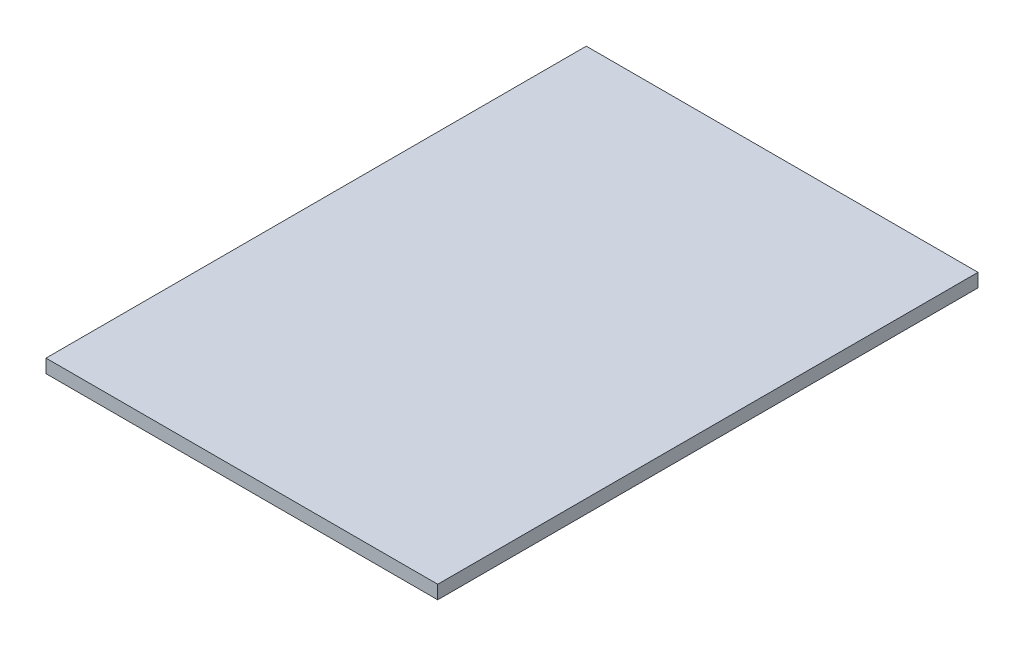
ISO-10303-21;
HEADER;
FILE_DESCRIPTION(('STEP AP214'),'2;1');
FILE_NAME('part.step','',(''),(''),'','','');
FILE_SCHEMA(('AUTOMOTIVE_DESIGN { 1 0 10303 214 1 1 1 1 }'));
ENDSEC;
DATA;
#1=APPLICATION_CONTEXT('core data for automotive mechanical design processes');
#2=APPLICATION_PROTOCOL_DEFINITION('international standard','automotive_design',2000,#1);
#3=PRODUCT_CONTEXT('',#1,'mechanical');
#4=PRODUCT('Part','Part','',(#3));
#5=PRODUCT_RELATED_PRODUCT_CATEGORY('part','',(#4));
#6=PRODUCT_DEFINITION_FORMATION('','',#4);
#7=PRODUCT_DEFINITION_CONTEXT('part definition',#1,'design');
#8=PRODUCT_DEFINITION('design','',#6,#7);
#9=PRODUCT_DEFINITION_SHAPE('','',#8);
#10=(LENGTH_UNIT() NAMED_UNIT(*) SI_UNIT(.MILLI.,.METRE.));
#11=(NAMED_UNIT(*) PLANE_ANGLE_UNIT() SI_UNIT($,.RADIAN.));
#12=(NAMED_UNIT(*) SI_UNIT($,.STERADIAN.) SOLID_ANGLE_UNIT());
#13=UNCERTAINTY_MEASURE_WITH_UNIT(LENGTH_MEASURE(1.E-05),#10,'distance_accuracy_value','');
#14=(GEOMETRIC_REPRESENTATION_CONTEXT(3) GLOBAL_UNCERTAINTY_ASSIGNED_CONTEXT((#13)) GLOBAL_UNIT_ASSIGNED_CONTEXT((#10,
#11,#12)) REPRESENTATION_CONTEXT('',''));
#15=CARTESIAN_POINT('',(0.,0.,0.));
#16=DIRECTION('',(0.,0.,1.));
#17=DIRECTION('',(1.,0.,0.));
#18=AXIS2_PLACEMENT_3D('',#15,#16,#17);
#19=CARTESIAN_POINT('',(0.,10.,0.));
#20=DIRECTION('',(1.,0.,0.));
#21=DIRECTION('',(0.,0.,-1.));
#22=AXIS2_PLACEMENT_3D('',#19,#20,#21);
#23=PLANE('',#22);
#24=DIRECTION('',(0.,0.,1.));
#25=VECTOR('',#24,1.);
#26=CARTESIAN_POINT('',(0.,0.,0.));
#27=LINE('',#26,#25);
#28=CARTESIAN_POINT('',(0.,0.,-400.));
#29=VERTEX_POINT('',#28);
#30=CARTESIAN_POINT('',(0.,0.,0.));
#31=VERTEX_POINT('',#30);
#32=EDGE_CURVE('E96',#29,#31,#27,.T.);
#33=ORIENTED_EDGE('',*,*,#32,.T.);
#34=DIRECTION('',(0.,-1.,0.));
#35=VECTOR('',#34,1.);
#36=CARTESIAN_POINT('',(0.,10.,0.));
#37=LINE('',#36,#35);
#38=CARTESIAN_POINT('',(0.,10.,0.));
#39=VERTEX_POINT('',#38);
#40=EDGE_CURVE('E11',#39,#31,#37,.T.);
#41=ORIENTED_EDGE('',*,*,#40,.F.);
#42=DIRECTION('',(0.,0.,1.));
#43=VECTOR('',#42,1.);
#44=CARTESIAN_POINT('',(0.,10.,0.));
#45=LINE('',#44,#43);
#46=CARTESIAN_POINT('',(0.,10.,-400.));
#47=VERTEX_POINT('',#46);
#48=EDGE_CURVE('E84',#47,#39,#45,.T.);
#49=ORIENTED_EDGE('',*,*,#48,.F.);
#50=DIRECTION('',(0.,-1.,0.));
#51=VECTOR('',#50,1.);
#52=CARTESIAN_POINT('',(0.,10.,-400.));
#53=LINE('',#52,#51);
#54=EDGE_CURVE('E92',#47,#29,#53,.T.);
#55=ORIENTED_EDGE('',*,*,#54,.T.);
#56=EDGE_LOOP('',(#33,#41,#49,#55));
#57=FACE_BOUND('',#56,.T.);
#58=ADVANCED_FACE('F33',(#57),#23,.F.);
#59=CARTESIAN_POINT('',(0.,10.,0.));
#60=DIRECTION('',(0.,0.,-1.));
#61=DIRECTION('',(-1.,0.,0.));
#62=AXIS2_PLACEMENT_3D('',#59,#60,#61);
#63=PLANE('',#62);
#64=DIRECTION('',(1.,0.,0.));
#65=VECTOR('',#64,1.);
#66=CARTESIAN_POINT('',(0.,0.,0.));
#67=LINE('',#66,#65);
#68=CARTESIAN_POINT('',(290.,0.,0.));
#69=VERTEX_POINT('',#68);
#70=EDGE_CURVE('E88',#31,#69,#67,.T.);
#71=ORIENTED_EDGE('',*,*,#70,.T.);
#72=DIRECTION('',(0.,-1.,0.));
#73=VECTOR('',#72,1.);
#74=CARTESIAN_POINT('',(290.,10.,0.));
#75=LINE('',#74,#73);
#76=CARTESIAN_POINT('',(290.,10.,0.));
#77=VERTEX_POINT('',#76);
#78=EDGE_CURVE('E41',#77,#69,#75,.T.);
#79=ORIENTED_EDGE('',*,*,#78,.F.);
#80=DIRECTION('',(1.,0.,0.));
#81=VECTOR('',#80,1.);
#82=CARTESIAN_POINT('',(0.,10.,0.));
#83=LINE('',#82,#81);
#84=EDGE_CURVE('E79',#39,#77,#83,.T.);
#85=ORIENTED_EDGE('',*,*,#84,.F.);
#86=ORIENTED_EDGE('',*,*,#40,.T.);
#87=EDGE_LOOP('',(#71,#79,#85,#86));
#88=FACE_BOUND('',#87,.T.);
#89=ADVANCED_FACE('F87',(#88),#63,.F.);
#90=CARTESIAN_POINT('',(290.,10.,0.));
#91=DIRECTION('',(-1.,0.,0.));
#92=DIRECTION('',(0.,0.,1.));
#93=AXIS2_PLACEMENT_3D('',#90,#91,#92);
#94=PLANE('',#93);
#95=DIRECTION('',(0.,0.,-1.));
#96=VECTOR('',#95,1.);
#97=CARTESIAN_POINT('',(290.,0.,0.));
#98=LINE('',#97,#96);
#99=CARTESIAN_POINT('',(290.,0.,-400.));
#100=VERTEX_POINT('',#99);
#101=EDGE_CURVE('E66',#69,#100,#98,.T.);
#102=ORIENTED_EDGE('',*,*,#101,.T.);
#103=DIRECTION('',(0.,-1.,0.));
#104=VECTOR('',#103,1.);
#105=CARTESIAN_POINT('',(290.,10.,-400.));
#106=LINE('',#105,#104);
#107=CARTESIAN_POINT('',(290.,10.,-400.));
#108=VERTEX_POINT('',#107);
#109=EDGE_CURVE('E89',#108,#100,#106,.T.);
#110=ORIENTED_EDGE('',*,*,#109,.F.);
#111=DIRECTION('',(0.,0.,-1.));
#112=VECTOR('',#111,1.);
#113=CARTESIAN_POINT('',(290.,10.,0.));
#114=LINE('',#113,#112);
#115=EDGE_CURVE('E82',#77,#108,#114,.T.);
#116=ORIENTED_EDGE('',*,*,#115,.F.);
#117=ORIENTED_EDGE('',*,*,#78,.T.);
#118=EDGE_LOOP('',(#102,#110,#116,#117));
#119=FACE_BOUND('',#118,.T.);
#120=ADVANCED_FACE('F90',(#119),#94,.F.);
#121=CARTESIAN_POINT('',(0.,10.,-400.));
#122=DIRECTION('',(0.,0.,1.));
#123=DIRECTION('',(1.,0.,0.));
#124=AXIS2_PLACEMENT_3D('',#121,#122,#123);
#125=PLANE('',#124);
#126=DIRECTION('',(-1.,0.,0.));
#127=VECTOR('',#126,1.);
#128=CARTESIAN_POINT('',(0.,0.,-400.));
#129=LINE('',#128,#127);
#130=EDGE_CURVE('E72',#100,#29,#129,.T.);
#131=ORIENTED_EDGE('',*,*,#130,.T.);
#132=ORIENTED_EDGE('',*,*,#54,.F.);
#133=DIRECTION('',(-1.,0.,0.));
#134=VECTOR('',#133,1.);
#135=CARTESIAN_POINT('',(0.,10.,-400.));
#136=LINE('',#135,#134);
#137=EDGE_CURVE('E49',#108,#47,#136,.T.);
#138=ORIENTED_EDGE('',*,*,#137,.F.);
#139=ORIENTED_EDGE('',*,*,#109,.T.);
#140=EDGE_LOOP('',(#131,#132,#138,#139));
#141=FACE_BOUND('',#140,.T.);
#142=ADVANCED_FACE('F103',(#141),#125,.F.);
#143=CARTESIAN_POINT('',(0.,10.,0.));
#144=DIRECTION('',(0.,-1.,0.));
#145=DIRECTION('',(0.,0.,-1.));
#146=AXIS2_PLACEMENT_3D('',#143,#144,#145);
#147=PLANE('',#146);
#148=ORIENTED_EDGE('',*,*,#48,.T.);
#149=ORIENTED_EDGE('',*,*,#84,.T.);
#150=ORIENTED_EDGE('',*,*,#115,.T.);
#151=ORIENTED_EDGE('',*,*,#137,.T.);
#152=EDGE_LOOP('',(#148,#149,#150,#151));
#153=FACE_BOUND('',#152,.T.);
#154=ADVANCED_FACE('F80',(#153),#147,.F.);
#155=CARTESIAN_POINT('',(0.,0.,0.));
#156=DIRECTION('',(0.,-1.,0.));
#157=DIRECTION('',(0.,0.,-1.));
#158=AXIS2_PLACEMENT_3D('',#155,#156,#157);
#159=PLANE('',#158);
#160=ORIENTED_EDGE('',*,*,#32,.F.);
#161=ORIENTED_EDGE('',*,*,#130,.F.);
#162=ORIENTED_EDGE('',*,*,#101,.F.);
#163=ORIENTED_EDGE('',*,*,#70,.F.);
#164=EDGE_LOOP('',(#160,#161,#162,#163));
#165=FACE_BOUND('',#164,.T.);
#166=ADVANCED_FACE('F106',(#165),#159,.T.);
#167=CLOSED_SHELL('',(#58,#89,#120,#142,#154,#166));
#168=MANIFOLD_SOLID_BREP('B2',#167);
#169=ADVANCED_BREP_SHAPE_REPRESENTATION('',(#18,#168),#14);
#170=SHAPE_DEFINITION_REPRESENTATION(#9,#169);
ENDSEC;
END-ISO-10303-21;
